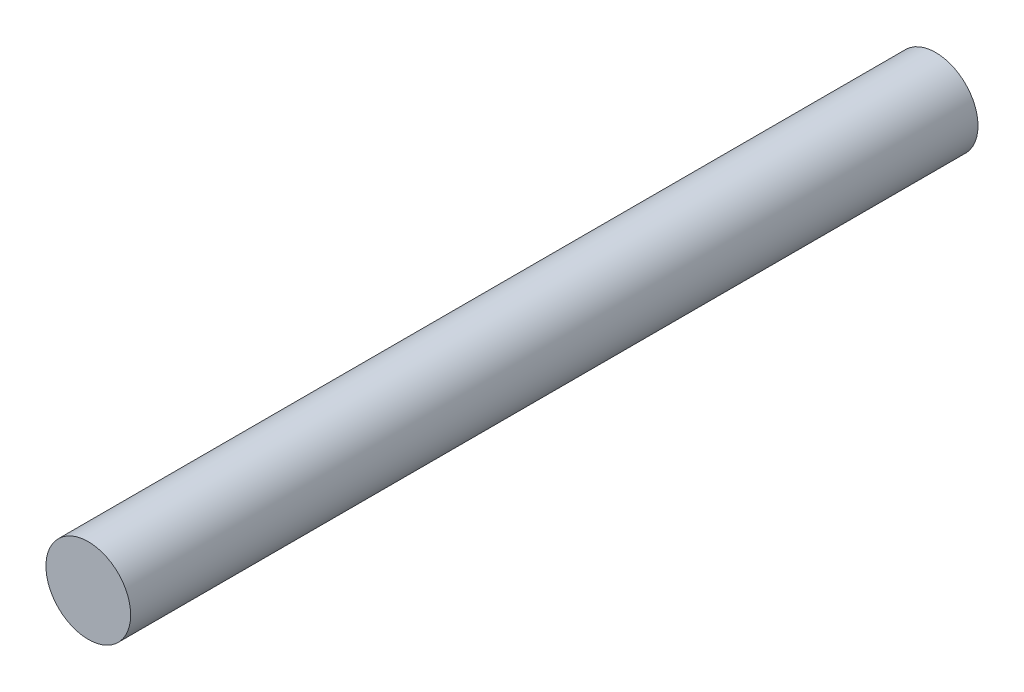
from build123d import *

# Parameters (mm, degrees)
ESQUISSE1_R          = 1
BASE_EXTRUSION_DEPTH = 10


with BuildPart() as part:
    # Esquisse1 → Base-Extrusion (new, symmetric)
    with BuildSketch(Plane.XY):
        Circle(ESQUISSE1_R)
    extrude(amount=BASE_EXTRUSION_DEPTH, both=True)


solid = part.part
